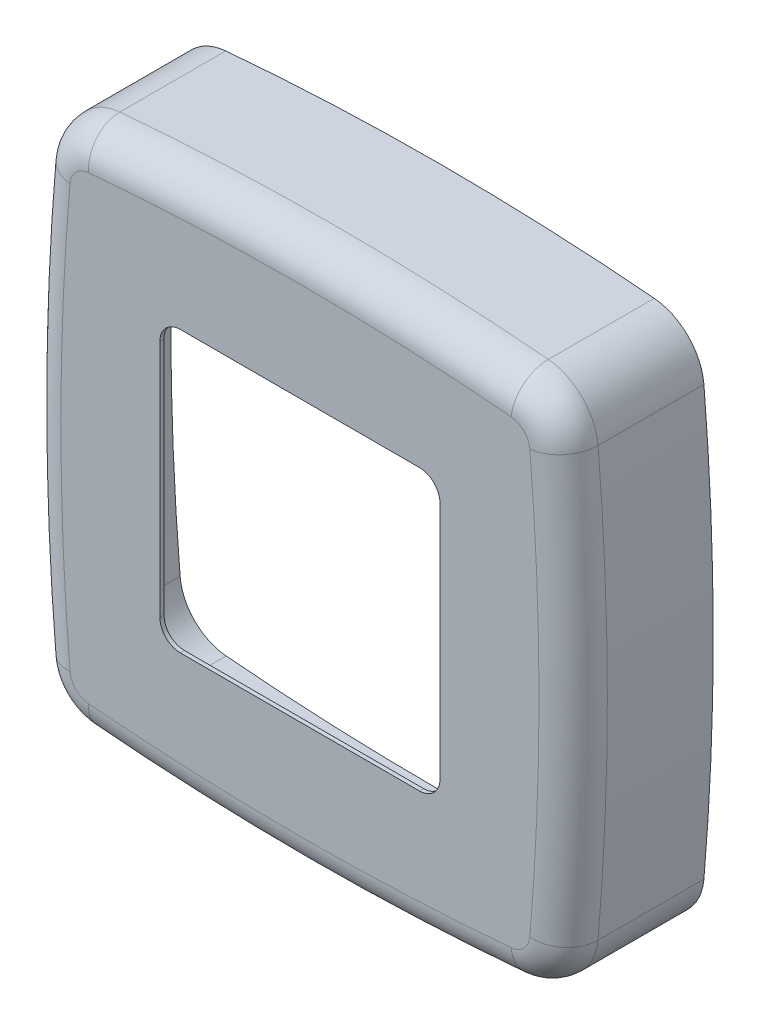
ISO-10303-21;
HEADER;
FILE_DESCRIPTION(('STEP AP214'),'2;1');
FILE_NAME('part.step','',(''),(''),'','','');
FILE_SCHEMA(('AUTOMOTIVE_DESIGN { 1 0 10303 214 1 1 1 1 }'));
ENDSEC;
DATA;
#1=APPLICATION_CONTEXT('core data for automotive mechanical design processes');
#2=APPLICATION_PROTOCOL_DEFINITION('international standard','automotive_design',2000,#1);
#3=PRODUCT_CONTEXT('',#1,'mechanical');
#4=PRODUCT('Part','Part','',(#3));
#5=PRODUCT_RELATED_PRODUCT_CATEGORY('part','',(#4));
#6=PRODUCT_DEFINITION_FORMATION('','',#4);
#7=PRODUCT_DEFINITION_CONTEXT('part definition',#1,'design');
#8=PRODUCT_DEFINITION('design','',#6,#7);
#9=PRODUCT_DEFINITION_SHAPE('','',#8);
#10=(LENGTH_UNIT() NAMED_UNIT(*) SI_UNIT(.MILLI.,.METRE.));
#11=(NAMED_UNIT(*) PLANE_ANGLE_UNIT() SI_UNIT($,.RADIAN.));
#12=(NAMED_UNIT(*) SI_UNIT($,.STERADIAN.) SOLID_ANGLE_UNIT());
#13=UNCERTAINTY_MEASURE_WITH_UNIT(LENGTH_MEASURE(1.E-05),#10,'distance_accuracy_value','');
#14=(GEOMETRIC_REPRESENTATION_CONTEXT(3) GLOBAL_UNCERTAINTY_ASSIGNED_CONTEXT((#13)) GLOBAL_UNIT_ASSIGNED_CONTEXT((#10,
#11,#12)) REPRESENTATION_CONTEXT('',''));
#15=CARTESIAN_POINT('',(0.,0.,0.));
#16=DIRECTION('',(0.,0.,1.));
#17=DIRECTION('',(1.,0.,0.));
#18=AXIS2_PLACEMENT_3D('',#15,#16,#17);
#19=CARTESIAN_POINT('',(20.5,-20.5,-105.732531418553));
#20=DIRECTION('',(0.,1.,0.));
#21=DIRECTION('',(-1.,0.,0.));
#22=AXIS2_PLACEMENT_3D('',#19,#20,#21);
#23=PLANE('',#22);
#24=DIRECTION('',(0.,0.,1.));
#25=VECTOR('',#24,1.);
#26=CARTESIAN_POINT('',(17.5,-20.5,-8.75));
#27=LINE('',#26,#25);
#28=CARTESIAN_POINT('',(17.5,-20.5,8.75));
#29=VERTEX_POINT('',#28);
#30=CARTESIAN_POINT('',(17.5,-20.5,8.15));
#31=VERTEX_POINT('',#30);
#32=EDGE_CURVE('E518',#29,#31,#27,.F.);
#33=ORIENTED_EDGE('',*,*,#32,.T.);
#34=DIRECTION('',(-1.,0.,0.));
#35=VECTOR('',#34,1.);
#36=CARTESIAN_POINT('',(0.,-20.5,8.15));
#37=LINE('',#36,#35);
#38=CARTESIAN_POINT('',(-17.5,-20.5,8.15));
#39=VERTEX_POINT('',#38);
#40=EDGE_CURVE('E325',#31,#39,#37,.T.);
#41=ORIENTED_EDGE('',*,*,#40,.T.);
#42=DIRECTION('',(0.,0.,1.));
#43=VECTOR('',#42,1.);
#44=CARTESIAN_POINT('',(-17.5,-20.5,8.75));
#45=LINE('',#44,#43);
#46=CARTESIAN_POINT('',(-17.5,-20.5,8.75));
#47=VERTEX_POINT('',#46);
#48=EDGE_CURVE('E523',#39,#47,#45,.T.);
#49=ORIENTED_EDGE('',*,*,#48,.T.);
#50=DIRECTION('',(-1.,0.,0.));
#51=VECTOR('',#50,1.);
#52=CARTESIAN_POINT('',(20.5,-20.5,8.75));
#53=LINE('',#52,#51);
#54=EDGE_CURVE('E419',#29,#47,#53,.T.);
#55=ORIENTED_EDGE('',*,*,#54,.F.);
#56=EDGE_LOOP('',(#33,#41,#49,#55));
#57=FACE_BOUND('',#56,.T.);
#58=ADVANCED_FACE('F48',(#57),#23,.T.);
#59=CARTESIAN_POINT('',(-20.5,-20.5,-105.732531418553));
#60=DIRECTION('',(1.,0.,0.));
#61=DIRECTION('',(0.,0.,-1.));
#62=AXIS2_PLACEMENT_3D('',#59,#60,#61);
#63=PLANE('',#62);
#64=DIRECTION('',(0.,0.,1.));
#65=VECTOR('',#64,1.);
#66=CARTESIAN_POINT('',(-20.5,-17.5,-8.75));
#67=LINE('',#66,#65);
#68=CARTESIAN_POINT('',(-20.5,-17.5,8.75));
#69=VERTEX_POINT('',#68);
#70=CARTESIAN_POINT('',(-20.5,-17.5,8.15));
#71=VERTEX_POINT('',#70);
#72=EDGE_CURVE('E525',#69,#71,#67,.F.);
#73=ORIENTED_EDGE('',*,*,#72,.T.);
#74=DIRECTION('',(0.,1.,0.));
#75=VECTOR('',#74,1.);
#76=CARTESIAN_POINT('',(-20.5,0.,8.15));
#77=LINE('',#76,#75);
#78=CARTESIAN_POINT('',(-20.5,17.5,8.15));
#79=VERTEX_POINT('',#78);
#80=EDGE_CURVE('E397',#71,#79,#77,.T.);
#81=ORIENTED_EDGE('',*,*,#80,.T.);
#82=DIRECTION('',(0.,0.,1.));
#83=VECTOR('',#82,1.);
#84=CARTESIAN_POINT('',(-20.5,17.5,8.75));
#85=LINE('',#84,#83);
#86=CARTESIAN_POINT('',(-20.5,17.5,8.75));
#87=VERTEX_POINT('',#86);
#88=EDGE_CURVE('E530',#79,#87,#85,.T.);
#89=ORIENTED_EDGE('',*,*,#88,.T.);
#90=DIRECTION('',(0.,1.,0.));
#91=VECTOR('',#90,1.);
#92=CARTESIAN_POINT('',(-20.5,-20.5,8.75));
#93=LINE('',#92,#91);
#94=EDGE_CURVE('E420',#69,#87,#93,.T.);
#95=ORIENTED_EDGE('',*,*,#94,.F.);
#96=EDGE_LOOP('',(#73,#81,#89,#95));
#97=FACE_BOUND('',#96,.T.);
#98=ADVANCED_FACE('F540',(#97),#63,.T.);
#99=CARTESIAN_POINT('',(-20.5,20.5,-105.732531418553));
#100=DIRECTION('',(0.,-1.,0.));
#101=DIRECTION('',(1.,0.,0.));
#102=AXIS2_PLACEMENT_3D('',#99,#100,#101);
#103=PLANE('',#102);
#104=DIRECTION('',(0.,0.,1.));
#105=VECTOR('',#104,1.);
#106=CARTESIAN_POINT('',(-17.5,20.5,-8.75));
#107=LINE('',#106,#105);
#108=CARTESIAN_POINT('',(-17.5,20.5,8.75));
#109=VERTEX_POINT('',#108);
#110=CARTESIAN_POINT('',(-17.5,20.5,8.15));
#111=VERTEX_POINT('',#110);
#112=EDGE_CURVE('E56',#109,#111,#107,.F.);
#113=ORIENTED_EDGE('',*,*,#112,.T.);
#114=DIRECTION('',(1.,0.,0.));
#115=VECTOR('',#114,1.);
#116=CARTESIAN_POINT('',(0.,20.5,8.15));
#117=LINE('',#116,#115);
#118=CARTESIAN_POINT('',(17.5,20.5,8.15));
#119=VERTEX_POINT('',#118);
#120=EDGE_CURVE('E63',#111,#119,#117,.T.);
#121=ORIENTED_EDGE('',*,*,#120,.T.);
#122=DIRECTION('',(0.,0.,1.));
#123=VECTOR('',#122,1.);
#124=CARTESIAN_POINT('',(17.5,20.5,8.75));
#125=LINE('',#124,#123);
#126=CARTESIAN_POINT('',(17.5,20.5,8.75));
#127=VERTEX_POINT('',#126);
#128=EDGE_CURVE('E489',#119,#127,#125,.T.);
#129=ORIENTED_EDGE('',*,*,#128,.T.);
#130=DIRECTION('',(1.,0.,0.));
#131=VECTOR('',#130,1.);
#132=CARTESIAN_POINT('',(-20.5,20.5,8.75));
#133=LINE('',#132,#131);
#134=EDGE_CURVE('E423',#109,#127,#133,.T.);
#135=ORIENTED_EDGE('',*,*,#134,.F.);
#136=EDGE_LOOP('',(#113,#121,#129,#135));
#137=FACE_BOUND('',#136,.T.);
#138=ADVANCED_FACE('F534',(#137),#103,.T.);
#139=CARTESIAN_POINT('',(20.5,20.5,-105.732531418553));
#140=DIRECTION('',(-1.,0.,0.));
#141=DIRECTION('',(0.,-1.,0.));
#142=AXIS2_PLACEMENT_3D('',#139,#140,#141);
#143=PLANE('',#142);
#144=DIRECTION('',(0.,0.,1.));
#145=VECTOR('',#144,1.);
#146=CARTESIAN_POINT('',(20.5,17.5,-8.75));
#147=LINE('',#146,#145);
#148=CARTESIAN_POINT('',(20.5,17.5,8.75));
#149=VERTEX_POINT('',#148);
#150=CARTESIAN_POINT('',(20.5,17.5,8.15));
#151=VERTEX_POINT('',#150);
#152=EDGE_CURVE('E511',#149,#151,#147,.F.);
#153=ORIENTED_EDGE('',*,*,#152,.T.);
#154=DIRECTION('',(0.,-1.,0.));
#155=VECTOR('',#154,1.);
#156=CARTESIAN_POINT('',(20.5,0.,8.15));
#157=LINE('',#156,#155);
#158=CARTESIAN_POINT('',(20.5,-17.5,8.15));
#159=VERTEX_POINT('',#158);
#160=EDGE_CURVE('E392',#151,#159,#157,.T.);
#161=ORIENTED_EDGE('',*,*,#160,.T.);
#162=DIRECTION('',(0.,0.,1.));
#163=VECTOR('',#162,1.);
#164=CARTESIAN_POINT('',(20.5,-17.5,8.75));
#165=LINE('',#164,#163);
#166=CARTESIAN_POINT('',(20.5,-17.5,8.75));
#167=VERTEX_POINT('',#166);
#168=EDGE_CURVE('E516',#159,#167,#165,.T.);
#169=ORIENTED_EDGE('',*,*,#168,.T.);
#170=DIRECTION('',(0.,-1.,0.));
#171=VECTOR('',#170,1.);
#172=CARTESIAN_POINT('',(20.5,20.5,8.75));
#173=LINE('',#172,#171);
#174=EDGE_CURVE('E426',#149,#167,#173,.T.);
#175=ORIENTED_EDGE('',*,*,#174,.F.);
#176=EDGE_LOOP('',(#153,#161,#169,#175));
#177=FACE_BOUND('',#176,.T.);
#178=ADVANCED_FACE('F555',(#177),#143,.T.);
#179=CARTESIAN_POINT('',(0.,0.,8.75));
#180=DIRECTION('',(0.,0.,1.));
#181=DIRECTION('',(1.,0.,0.));
#182=AXIS2_PLACEMENT_3D('',#179,#180,#181);
#183=PLANE('',#182);
#184=CARTESIAN_POINT('',(-30.6689854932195,-30.6689854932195,8.75));
#185=DIRECTION('',(0.,0.,1.));
#186=DIRECTION('',(1.,0.,0.));
#187=AXIS2_PLACEMENT_3D('',#184,#185,#186);
#188=CIRCLE('',#187,3.);
#189=CARTESIAN_POINT('',(-33.6577057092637,-30.9288921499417,8.75));
#190=VERTEX_POINT('',#189);
#191=CARTESIAN_POINT('',(-30.9288921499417,-33.6577057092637,8.75));
#192=VERTEX_POINT('',#191);
#193=EDGE_CURVE('E467',#190,#192,#188,.T.);
#194=ORIENTED_EDGE('',*,*,#193,.T.);
#195=CARTESIAN_POINT('',(0.,322.,8.75));
#196=DIRECTION('',(0.,0.,1.));
#197=DIRECTION('',(1.,0.,0.));
#198=AXIS2_PLACEMENT_3D('',#195,#196,#197);
#199=CIRCLE('',#198,357.);
#200=CARTESIAN_POINT('',(30.9288921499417,-33.6577057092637,8.75));
#201=VERTEX_POINT('',#200);
#202=EDGE_CURVE('E469',#192,#201,#199,.T.);
#203=ORIENTED_EDGE('',*,*,#202,.T.);
#204=CARTESIAN_POINT('',(30.6689854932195,-30.6689854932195,8.75));
#205=DIRECTION('',(0.,0.,1.));
#206=DIRECTION('',(1.,0.,0.));
#207=AXIS2_PLACEMENT_3D('',#204,#205,#206);
#208=CIRCLE('',#207,3.);
#209=CARTESIAN_POINT('',(33.6577057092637,-30.9288921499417,8.75));
#210=VERTEX_POINT('',#209);
#211=EDGE_CURVE('E465',#201,#210,#208,.T.);
#212=ORIENTED_EDGE('',*,*,#211,.T.);
#213=CARTESIAN_POINT('',(-322.,0.,8.75));
#214=DIRECTION('',(0.,0.,1.));
#215=DIRECTION('',(1.,0.,0.));
#216=AXIS2_PLACEMENT_3D('',#213,#214,#215);
#217=CIRCLE('',#216,357.);
#218=CARTESIAN_POINT('',(33.6577057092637,30.9288921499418,8.75));
#219=VERTEX_POINT('',#218);
#220=EDGE_CURVE('E461',#210,#219,#217,.T.);
#221=ORIENTED_EDGE('',*,*,#220,.T.);
#222=CARTESIAN_POINT('',(30.6689854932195,30.6689854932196,8.75));
#223=DIRECTION('',(0.,0.,1.));
#224=DIRECTION('',(1.,0.,0.));
#225=AXIS2_PLACEMENT_3D('',#222,#223,#224);
#226=CIRCLE('',#225,3.);
#227=CARTESIAN_POINT('',(30.9288921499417,33.6577057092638,8.75));
#228=VERTEX_POINT('',#227);
#229=EDGE_CURVE('E457',#219,#228,#226,.T.);
#230=ORIENTED_EDGE('',*,*,#229,.T.);
#231=CARTESIAN_POINT('',(0.,-322.,8.75));
#232=DIRECTION('',(0.,0.,1.));
#233=DIRECTION('',(1.,0.,0.));
#234=AXIS2_PLACEMENT_3D('',#231,#232,#233);
#235=CIRCLE('',#234,357.);
#236=CARTESIAN_POINT('',(-30.9288921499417,33.6577057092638,8.75));
#237=VERTEX_POINT('',#236);
#238=EDGE_CURVE('E455',#228,#237,#235,.T.);
#239=ORIENTED_EDGE('',*,*,#238,.T.);
#240=CARTESIAN_POINT('',(-30.6689854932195,30.6689854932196,8.75));
#241=DIRECTION('',(0.,0.,1.));
#242=DIRECTION('',(1.,0.,0.));
#243=AXIS2_PLACEMENT_3D('',#240,#241,#242);
#244=CIRCLE('',#243,3.);
#245=CARTESIAN_POINT('',(-33.6577057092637,30.9288921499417,8.75));
#246=VERTEX_POINT('',#245);
#247=EDGE_CURVE('E459',#237,#246,#244,.T.);
#248=ORIENTED_EDGE('',*,*,#247,.T.);
#249=CARTESIAN_POINT('',(322.,0.,8.75));
#250=DIRECTION('',(0.,0.,1.));
#251=DIRECTION('',(1.,0.,0.));
#252=AXIS2_PLACEMENT_3D('',#249,#250,#251);
#253=CIRCLE('',#252,357.);
#254=EDGE_CURVE('E463',#246,#190,#253,.T.);
#255=ORIENTED_EDGE('',*,*,#254,.T.);
#256=EDGE_LOOP('',(#194,#203,#212,#221,#230,#239,#248,#255));
#257=FACE_BOUND('',#256,.T.);
#258=ORIENTED_EDGE('',*,*,#94,.T.);
#259=CARTESIAN_POINT('',(-17.5,17.5,8.75));
#260=DIRECTION('',(0.,0.,1.));
#261=DIRECTION('',(1.,0.,0.));
#262=AXIS2_PLACEMENT_3D('',#259,#260,#261);
#263=CIRCLE('',#262,3.);
#264=EDGE_CURVE('E11',#87,#109,#263,.F.);
#265=ORIENTED_EDGE('',*,*,#264,.T.);
#266=ORIENTED_EDGE('',*,*,#134,.T.);
#267=CARTESIAN_POINT('',(17.5,17.5,8.75));
#268=DIRECTION('',(0.,0.,1.));
#269=DIRECTION('',(1.,0.,0.));
#270=AXIS2_PLACEMENT_3D('',#267,#268,#269);
#271=CIRCLE('',#270,3.);
#272=EDGE_CURVE('E514',#127,#149,#271,.F.);
#273=ORIENTED_EDGE('',*,*,#272,.T.);
#274=ORIENTED_EDGE('',*,*,#174,.T.);
#275=CARTESIAN_POINT('',(17.5,-17.5,8.75));
#276=DIRECTION('',(0.,0.,1.));
#277=DIRECTION('',(1.,0.,0.));
#278=AXIS2_PLACEMENT_3D('',#275,#276,#277);
#279=CIRCLE('',#278,3.);
#280=EDGE_CURVE('E521',#167,#29,#279,.F.);
#281=ORIENTED_EDGE('',*,*,#280,.T.);
#282=ORIENTED_EDGE('',*,*,#54,.T.);
#283=CARTESIAN_POINT('',(-17.5,-17.5,8.75));
#284=DIRECTION('',(0.,0.,1.));
#285=DIRECTION('',(1.,0.,0.));
#286=AXIS2_PLACEMENT_3D('',#283,#284,#285);
#287=CIRCLE('',#286,3.);
#288=EDGE_CURVE('E528',#47,#69,#287,.F.);
#289=ORIENTED_EDGE('',*,*,#288,.T.);
#290=EDGE_LOOP('',(#258,#265,#266,#273,#274,#281,#282,#289));
#291=FACE_BOUND('',#290,.T.);
#292=ADVANCED_FACE('F561',(#257,#291),#183,.T.);
#293=CARTESIAN_POINT('',(0.,322.,-105.732531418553));
#294=DIRECTION('',(0.,0.,1.));
#295=DIRECTION('',(1.,0.,0.));
#296=AXIS2_PLACEMENT_3D('',#293,#294,#295);
#297=CYLINDRICAL_SURFACE('',#296,362.);
#298=DIRECTION('',(0.,0.,1.));
#299=VECTOR('',#298,1.);
#300=CARTESIAN_POINT('',(31.3620699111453,-38.6389060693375,-105.732531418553));
#301=LINE('',#300,#299);
#302=CARTESIAN_POINT('',(31.3620699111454,-38.6389060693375,-11.75));
#303=VERTEX_POINT('',#302);
#304=CARTESIAN_POINT('',(31.3620699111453,-38.6389060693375,3.75));
#305=VERTEX_POINT('',#304);
#306=EDGE_CURVE('E440',#303,#305,#301,.T.);
#307=ORIENTED_EDGE('',*,*,#306,.T.);
#308=CARTESIAN_POINT('',(0.,322.,3.75));
#309=DIRECTION('',(0.,0.,1.));
#310=DIRECTION('',(1.,0.,0.));
#311=AXIS2_PLACEMENT_3D('',#308,#309,#310);
#312=CIRCLE('',#311,362.);
#313=CARTESIAN_POINT('',(-31.3620699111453,-38.6389060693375,3.75));
#314=VERTEX_POINT('',#313);
#315=EDGE_CURVE('E472',#305,#314,#312,.F.);
#316=ORIENTED_EDGE('',*,*,#315,.T.);
#317=DIRECTION('',(0.,0.,1.));
#318=VECTOR('',#317,1.);
#319=CARTESIAN_POINT('',(-31.3620699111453,-38.6389060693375,-105.732531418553));
#320=LINE('',#319,#318);
#321=CARTESIAN_POINT('',(-31.3620699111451,-38.6389060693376,-11.75));
#322=VERTEX_POINT('',#321);
#323=EDGE_CURVE('E448',#314,#322,#320,.F.);
#324=ORIENTED_EDGE('',*,*,#323,.T.);
#325=CARTESIAN_POINT('',(0.,322.,-11.75));
#326=DIRECTION('',(0.,0.,-1.));
#327=DIRECTION('',(-1.,0.,0.));
#328=AXIS2_PLACEMENT_3D('',#325,#326,#327);
#329=CIRCLE('',#328,362.);
#330=EDGE_CURVE('E322',#303,#322,#329,.T.);
#331=ORIENTED_EDGE('',*,*,#330,.F.);
#332=EDGE_LOOP('',(#307,#316,#324,#331));
#333=FACE_BOUND('',#332,.T.);
#334=ADVANCED_FACE('F563',(#333),#297,.T.);
#335=CARTESIAN_POINT('',(322.,0.,-105.732531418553));
#336=DIRECTION('',(0.,0.,1.));
#337=DIRECTION('',(1.,0.,0.));
#338=AXIS2_PLACEMENT_3D('',#335,#336,#337);
#339=CYLINDRICAL_SURFACE('',#338,362.);
#340=DIRECTION('',(0.,0.,1.));
#341=VECTOR('',#340,1.);
#342=CARTESIAN_POINT('',(-38.6389060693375,-31.3620699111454,-105.732531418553));
#343=LINE('',#342,#341);
#344=CARTESIAN_POINT('',(-38.6389060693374,-31.3620699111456,-11.75));
#345=VERTEX_POINT('',#344);
#346=CARTESIAN_POINT('',(-38.6389060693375,-31.3620699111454,3.75));
#347=VERTEX_POINT('',#346);
#348=EDGE_CURVE('E445',#345,#347,#343,.T.);
#349=ORIENTED_EDGE('',*,*,#348,.T.);
#350=CARTESIAN_POINT('',(322.,0.,3.75));
#351=DIRECTION('',(0.,0.,1.));
#352=DIRECTION('',(1.,0.,0.));
#353=AXIS2_PLACEMENT_3D('',#350,#351,#352);
#354=CIRCLE('',#353,362.);
#355=CARTESIAN_POINT('',(-38.6389060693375,31.3620699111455,3.75));
#356=VERTEX_POINT('',#355);
#357=EDGE_CURVE('E479',#347,#356,#354,.F.);
#358=ORIENTED_EDGE('',*,*,#357,.T.);
#359=DIRECTION('',(0.,0.,1.));
#360=VECTOR('',#359,1.);
#361=CARTESIAN_POINT('',(-38.6389060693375,31.3620699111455,-105.732531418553));
#362=LINE('',#361,#360);
#363=CARTESIAN_POINT('',(-38.6389060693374,31.3620699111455,-11.75));
#364=VERTEX_POINT('',#363);
#365=EDGE_CURVE('E453',#356,#364,#362,.F.);
#366=ORIENTED_EDGE('',*,*,#365,.T.);
#367=CARTESIAN_POINT('',(322.,0.,-11.75));
#368=DIRECTION('',(0.,0.,-1.));
#369=DIRECTION('',(-1.,0.,0.));
#370=AXIS2_PLACEMENT_3D('',#367,#368,#369);
#371=CIRCLE('',#370,362.);
#372=EDGE_CURVE('E304',#345,#364,#371,.T.);
#373=ORIENTED_EDGE('',*,*,#372,.F.);
#374=EDGE_LOOP('',(#349,#358,#366,#373));
#375=FACE_BOUND('',#374,.T.);
#376=ADVANCED_FACE('F570',(#375),#339,.T.);
#377=CARTESIAN_POINT('',(0.,-322.,-105.732531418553));
#378=DIRECTION('',(0.,0.,1.));
#379=DIRECTION('',(1.,0.,0.));
#380=AXIS2_PLACEMENT_3D('',#377,#378,#379);
#381=CYLINDRICAL_SURFACE('',#380,362.);
#382=DIRECTION('',(0.,0.,1.));
#383=VECTOR('',#382,1.);
#384=CARTESIAN_POINT('',(-31.3620699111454,38.6389060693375,-105.732531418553));
#385=LINE('',#384,#383);
#386=CARTESIAN_POINT('',(-31.3620699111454,38.6389060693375,-11.75));
#387=VERTEX_POINT('',#386);
#388=CARTESIAN_POINT('',(-31.3620699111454,38.6389060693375,3.75));
#389=VERTEX_POINT('',#388);
#390=EDGE_CURVE('E450',#387,#389,#385,.T.);
#391=ORIENTED_EDGE('',*,*,#390,.T.);
#392=CARTESIAN_POINT('',(0.,-322.,3.75));
#393=DIRECTION('',(0.,0.,1.));
#394=DIRECTION('',(1.,0.,0.));
#395=AXIS2_PLACEMENT_3D('',#392,#393,#394);
#396=CIRCLE('',#395,362.);
#397=CARTESIAN_POINT('',(31.3620699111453,38.6389060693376,3.75));
#398=VERTEX_POINT('',#397);
#399=EDGE_CURVE('E487',#389,#398,#396,.F.);
#400=ORIENTED_EDGE('',*,*,#399,.T.);
#401=DIRECTION('',(0.,0.,1.));
#402=VECTOR('',#401,1.);
#403=CARTESIAN_POINT('',(31.3620699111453,38.6389060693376,-105.732531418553));
#404=LINE('',#403,#402);
#405=CARTESIAN_POINT('',(31.3620699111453,38.6389060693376,-11.75));
#406=VERTEX_POINT('',#405);
#407=EDGE_CURVE('E437',#398,#406,#404,.F.);
#408=ORIENTED_EDGE('',*,*,#407,.T.);
#409=CARTESIAN_POINT('',(0.,-322.,-11.75));
#410=DIRECTION('',(0.,0.,-1.));
#411=DIRECTION('',(-1.,0.,0.));
#412=AXIS2_PLACEMENT_3D('',#409,#410,#411);
#413=CIRCLE('',#412,362.);
#414=EDGE_CURVE('E310',#387,#406,#413,.T.);
#415=ORIENTED_EDGE('',*,*,#414,.F.);
#416=EDGE_LOOP('',(#391,#400,#408,#415));
#417=FACE_BOUND('',#416,.T.);
#418=ADVANCED_FACE('F588',(#417),#381,.T.);
#419=CARTESIAN_POINT('',(-322.,0.,-105.732531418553));
#420=DIRECTION('',(0.,0.,1.));
#421=DIRECTION('',(1.,0.,0.));
#422=AXIS2_PLACEMENT_3D('',#419,#420,#421);
#423=CYLINDRICAL_SURFACE('',#422,362.);
#424=DIRECTION('',(0.,0.,1.));
#425=VECTOR('',#424,1.);
#426=CARTESIAN_POINT('',(38.6389060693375,31.3620699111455,-105.732531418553));
#427=LINE('',#426,#425);
#428=CARTESIAN_POINT('',(38.6389060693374,31.3620699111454,-11.75));
#429=VERTEX_POINT('',#428);
#430=CARTESIAN_POINT('',(38.6389060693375,31.3620699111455,3.75));
#431=VERTEX_POINT('',#430);
#432=EDGE_CURVE('E434',#429,#431,#427,.T.);
#433=ORIENTED_EDGE('',*,*,#432,.T.);
#434=CARTESIAN_POINT('',(-322.,0.,3.75));
#435=DIRECTION('',(0.,0.,1.));
#436=DIRECTION('',(1.,0.,0.));
#437=AXIS2_PLACEMENT_3D('',#434,#435,#436);
#438=CIRCLE('',#437,362.);
#439=CARTESIAN_POINT('',(38.6389060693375,-31.3620699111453,3.75));
#440=VERTEX_POINT('',#439);
#441=EDGE_CURVE('E481',#431,#440,#438,.F.);
#442=ORIENTED_EDGE('',*,*,#441,.T.);
#443=DIRECTION('',(0.,0.,1.));
#444=VECTOR('',#443,1.);
#445=CARTESIAN_POINT('',(38.6389060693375,-31.3620699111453,-105.732531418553));
#446=LINE('',#445,#444);
#447=CARTESIAN_POINT('',(38.6389060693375,-31.3620699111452,-11.75));
#448=VERTEX_POINT('',#447);
#449=EDGE_CURVE('E443',#440,#448,#446,.F.);
#450=ORIENTED_EDGE('',*,*,#449,.T.);
#451=CARTESIAN_POINT('',(-322.,0.,-11.75));
#452=DIRECTION('',(0.,0.,-1.));
#453=DIRECTION('',(-1.,0.,0.));
#454=AXIS2_PLACEMENT_3D('',#451,#452,#453);
#455=CIRCLE('',#454,362.);
#456=EDGE_CURVE('E316',#429,#448,#455,.T.);
#457=ORIENTED_EDGE('',*,*,#456,.F.);
#458=EDGE_LOOP('',(#433,#442,#450,#457));
#459=FACE_BOUND('',#458,.T.);
#460=ADVANCED_FACE('F584',(#459),#423,.T.);
#461=CARTESIAN_POINT('',(30.6689854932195,30.6689854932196,-105.732531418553));
#462=DIRECTION('',(0.,0.,1.));
#463=DIRECTION('',(1.,0.,0.));
#464=AXIS2_PLACEMENT_3D('',#461,#462,#463);
#465=CYLINDRICAL_SURFACE('',#464,8.);
#466=ORIENTED_EDGE('',*,*,#407,.F.);
#467=CARTESIAN_POINT('',(30.6689854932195,30.6689854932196,3.75));
#468=DIRECTION('',(0.,0.,1.));
#469=DIRECTION('',(1.,0.,0.));
#470=AXIS2_PLACEMENT_3D('',#467,#468,#469);
#471=CIRCLE('',#470,8.);
#472=EDGE_CURVE('E485',#398,#431,#471,.F.);
#473=ORIENTED_EDGE('',*,*,#472,.T.);
#474=ORIENTED_EDGE('',*,*,#432,.F.);
#475=CARTESIAN_POINT('',(30.6689854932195,30.6689854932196,-11.75));
#476=DIRECTION('',(0.,0.,-1.));
#477=DIRECTION('',(-1.,0.,0.));
#478=AXIS2_PLACEMENT_3D('',#475,#476,#477);
#479=CIRCLE('',#478,8.00000000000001);
#480=EDGE_CURVE('E313',#406,#429,#479,.T.);
#481=ORIENTED_EDGE('',*,*,#480,.F.);
#482=EDGE_LOOP('',(#466,#473,#474,#481));
#483=FACE_BOUND('',#482,.T.);
#484=ADVANCED_FACE('F587',(#483),#465,.T.);
#485=CARTESIAN_POINT('',(30.6689854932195,-30.6689854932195,-105.732531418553));
#486=DIRECTION('',(0.,0.,1.));
#487=DIRECTION('',(1.,0.,0.));
#488=AXIS2_PLACEMENT_3D('',#485,#486,#487);
#489=CYLINDRICAL_SURFACE('',#488,8.);
#490=ORIENTED_EDGE('',*,*,#449,.F.);
#491=CARTESIAN_POINT('',(30.6689854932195,-30.6689854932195,3.75));
#492=DIRECTION('',(0.,0.,1.));
#493=DIRECTION('',(1.,0.,0.));
#494=AXIS2_PLACEMENT_3D('',#491,#492,#493);
#495=CIRCLE('',#494,8.);
#496=EDGE_CURVE('E477',#440,#305,#495,.F.);
#497=ORIENTED_EDGE('',*,*,#496,.T.);
#498=ORIENTED_EDGE('',*,*,#306,.F.);
#499=CARTESIAN_POINT('',(30.6689854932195,-30.6689854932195,-11.75));
#500=DIRECTION('',(0.,0.,-1.));
#501=DIRECTION('',(-1.,0.,0.));
#502=AXIS2_PLACEMENT_3D('',#499,#500,#501);
#503=CIRCLE('',#502,8.00000000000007);
#504=EDGE_CURVE('E319',#448,#303,#503,.T.);
#505=ORIENTED_EDGE('',*,*,#504,.F.);
#506=EDGE_LOOP('',(#490,#497,#498,#505));
#507=FACE_BOUND('',#506,.T.);
#508=ADVANCED_FACE('F641',(#507),#489,.T.);
#509=CARTESIAN_POINT('',(-30.6689854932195,-30.6689854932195,-105.732531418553));
#510=DIRECTION('',(0.,0.,1.));
#511=DIRECTION('',(1.,0.,0.));
#512=AXIS2_PLACEMENT_3D('',#509,#510,#511);
#513=CYLINDRICAL_SURFACE('',#512,8.);
#514=ORIENTED_EDGE('',*,*,#323,.F.);
#515=CARTESIAN_POINT('',(-30.6689854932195,-30.6689854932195,3.75));
#516=DIRECTION('',(0.,0.,1.));
#517=DIRECTION('',(1.,0.,0.));
#518=AXIS2_PLACEMENT_3D('',#515,#516,#517);
#519=CIRCLE('',#518,8.);
#520=EDGE_CURVE('E475',#314,#347,#519,.F.);
#521=ORIENTED_EDGE('',*,*,#520,.T.);
#522=ORIENTED_EDGE('',*,*,#348,.F.);
#523=CARTESIAN_POINT('',(-30.6689854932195,-30.6689854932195,-11.75));
#524=DIRECTION('',(0.,0.,-1.));
#525=DIRECTION('',(-1.,0.,0.));
#526=AXIS2_PLACEMENT_3D('',#523,#524,#525);
#527=CIRCLE('',#526,8.00000000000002);
#528=EDGE_CURVE('E301',#322,#345,#527,.T.);
#529=ORIENTED_EDGE('',*,*,#528,.F.);
#530=EDGE_LOOP('',(#514,#521,#522,#529));
#531=FACE_BOUND('',#530,.T.);
#532=ADVANCED_FACE('F1059',(#531),#513,.T.);
#533=CARTESIAN_POINT('',(-30.6689854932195,30.6689854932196,-105.732531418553));
#534=DIRECTION('',(0.,0.,1.));
#535=DIRECTION('',(1.,0.,0.));
#536=AXIS2_PLACEMENT_3D('',#533,#534,#535);
#537=CYLINDRICAL_SURFACE('',#536,8.);
#538=ORIENTED_EDGE('',*,*,#365,.F.);
#539=CARTESIAN_POINT('',(-30.6689854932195,30.6689854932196,3.75));
#540=DIRECTION('',(0.,0.,1.));
#541=DIRECTION('',(1.,0.,0.));
#542=AXIS2_PLACEMENT_3D('',#539,#540,#541);
#543=CIRCLE('',#542,8.);
#544=EDGE_CURVE('E483',#356,#389,#543,.F.);
#545=ORIENTED_EDGE('',*,*,#544,.T.);
#546=ORIENTED_EDGE('',*,*,#390,.F.);
#547=CARTESIAN_POINT('',(-30.6689854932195,30.6689854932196,-11.75));
#548=DIRECTION('',(0.,0.,-1.));
#549=DIRECTION('',(-1.,0.,0.));
#550=AXIS2_PLACEMENT_3D('',#547,#548,#549);
#551=CIRCLE('',#550,7.99999999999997);
#552=EDGE_CURVE('E307',#364,#387,#551,.T.);
#553=ORIENTED_EDGE('',*,*,#552,.F.);
#554=EDGE_LOOP('',(#538,#545,#546,#553));
#555=FACE_BOUND('',#554,.T.);
#556=ADVANCED_FACE('F619',(#555),#537,.T.);
#557=CARTESIAN_POINT('',(0.,-322.,3.75));
#558=DIRECTION('',(0.,0.,1.));
#559=DIRECTION('',(1.,0.,0.));
#560=AXIS2_PLACEMENT_3D('',#557,#558,#559);
#561=TOROIDAL_SURFACE('',#560,357.,5.);
#562=CARTESIAN_POINT('',(30.9288921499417,33.6577057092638,3.75));
#563=DIRECTION('',(0.996240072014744,-0.0866355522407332,0.));
#564=DIRECTION('',(0.0866355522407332,0.996240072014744,0.));
#565=AXIS2_PLACEMENT_3D('',#562,#563,#564);
#566=CIRCLE('',#565,5.);
#567=EDGE_CURVE('E505',#398,#228,#566,.T.);
#568=ORIENTED_EDGE('',*,*,#567,.F.);
#569=ORIENTED_EDGE('',*,*,#399,.F.);
#570=CARTESIAN_POINT('',(-30.9288921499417,33.6577057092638,3.75));
#571=DIRECTION('',(-0.996240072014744,-0.0866355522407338,0.));
#572=DIRECTION('',(0.0866355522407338,-0.996240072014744,0.));
#573=AXIS2_PLACEMENT_3D('',#570,#571,#572);
#574=CIRCLE('',#573,5.);
#575=EDGE_CURVE('E438',#237,#389,#574,.T.);
#576=ORIENTED_EDGE('',*,*,#575,.F.);
#577=ORIENTED_EDGE('',*,*,#238,.F.);
#578=EDGE_LOOP('',(#568,#569,#576,#577));
#579=FACE_BOUND('',#578,.T.);
#580=ADVANCED_FACE('F626',(#579),#561,.T.);
#581=CARTESIAN_POINT('',(-30.6689854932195,30.6689854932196,3.75));
#582=DIRECTION('',(0.,0.,1.));
#583=DIRECTION('',(1.,0.,0.));
#584=AXIS2_PLACEMENT_3D('',#581,#582,#583);
#585=DEGENERATE_TOROIDAL_SURFACE('',#584,3.,5.,.T.);
#586=ORIENTED_EDGE('',*,*,#575,.T.);
#587=ORIENTED_EDGE('',*,*,#544,.F.);
#588=CARTESIAN_POINT('',(-33.6577057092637,30.9288921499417,3.75));
#589=DIRECTION('',(-0.0866355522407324,-0.996240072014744,0.));
#590=DIRECTION('',(0.996240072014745,-0.0866355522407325,0.));
#591=AXIS2_PLACEMENT_3D('',#588,#589,#590);
#592=CIRCLE('',#591,5.);
#593=EDGE_CURVE('E502',#246,#356,#592,.T.);
#594=ORIENTED_EDGE('',*,*,#593,.F.);
#595=ORIENTED_EDGE('',*,*,#247,.F.);
#596=EDGE_LOOP('',(#586,#587,#594,#595));
#597=FACE_BOUND('',#596,.T.);
#598=ADVANCED_FACE('F617',(#597),#585,.T.);
#599=CARTESIAN_POINT('',(30.6689854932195,30.6689854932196,3.75));
#600=DIRECTION('',(0.,0.,1.));
#601=DIRECTION('',(1.,0.,0.));
#602=AXIS2_PLACEMENT_3D('',#599,#600,#601);
#603=DEGENERATE_TOROIDAL_SURFACE('',#602,3.,5.,.T.);
#604=ORIENTED_EDGE('',*,*,#567,.T.);
#605=ORIENTED_EDGE('',*,*,#229,.F.);
#606=CARTESIAN_POINT('',(33.6577057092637,30.9288921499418,3.75));
#607=DIRECTION('',(0.0866355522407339,-0.996240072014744,0.));
#608=DIRECTION('',(0.996240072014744,0.0866355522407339,0.));
#609=AXIS2_PLACEMENT_3D('',#606,#607,#608);
#610=CIRCLE('',#609,5.);
#611=EDGE_CURVE('E499',#431,#219,#610,.T.);
#612=ORIENTED_EDGE('',*,*,#611,.F.);
#613=ORIENTED_EDGE('',*,*,#472,.F.);
#614=EDGE_LOOP('',(#604,#605,#612,#613));
#615=FACE_BOUND('',#614,.T.);
#616=ADVANCED_FACE('F631',(#615),#603,.T.);
#617=CARTESIAN_POINT('',(322.,0.,3.75));
#618=DIRECTION('',(0.,0.,1.));
#619=DIRECTION('',(1.,0.,0.));
#620=AXIS2_PLACEMENT_3D('',#617,#618,#619);
#621=TOROIDAL_SURFACE('',#620,357.,5.);
#622=ORIENTED_EDGE('',*,*,#593,.T.);
#623=ORIENTED_EDGE('',*,*,#357,.F.);
#624=CARTESIAN_POINT('',(-33.6577057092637,-30.9288921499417,3.75));
#625=DIRECTION('',(0.0866355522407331,-0.996240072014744,0.));
#626=DIRECTION('',(0.996240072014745,0.0866355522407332,0.));
#627=AXIS2_PLACEMENT_3D('',#624,#625,#626);
#628=CIRCLE('',#627,5.);
#629=EDGE_CURVE('E496',#190,#347,#628,.T.);
#630=ORIENTED_EDGE('',*,*,#629,.F.);
#631=ORIENTED_EDGE('',*,*,#254,.F.);
#632=EDGE_LOOP('',(#622,#623,#630,#631));
#633=FACE_BOUND('',#632,.T.);
#634=ADVANCED_FACE('F603',(#633),#621,.T.);
#635=CARTESIAN_POINT('',(-322.,0.,3.75));
#636=DIRECTION('',(0.,0.,1.));
#637=DIRECTION('',(1.,0.,0.));
#638=AXIS2_PLACEMENT_3D('',#635,#636,#637);
#639=TOROIDAL_SURFACE('',#638,357.,5.);
#640=ORIENTED_EDGE('',*,*,#611,.T.);
#641=ORIENTED_EDGE('',*,*,#220,.F.);
#642=CARTESIAN_POINT('',(33.6577057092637,-30.9288921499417,3.75));
#643=DIRECTION('',(-0.0866355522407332,-0.996240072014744,0.));
#644=DIRECTION('',(0.996240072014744,-0.0866355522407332,0.));
#645=AXIS2_PLACEMENT_3D('',#642,#643,#644);
#646=CIRCLE('',#645,5.);
#647=EDGE_CURVE('E493',#440,#210,#646,.T.);
#648=ORIENTED_EDGE('',*,*,#647,.F.);
#649=ORIENTED_EDGE('',*,*,#441,.F.);
#650=EDGE_LOOP('',(#640,#641,#648,#649));
#651=FACE_BOUND('',#650,.T.);
#652=ADVANCED_FACE('F654',(#651),#639,.T.);
#653=CARTESIAN_POINT('',(-30.6689854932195,-30.6689854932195,3.75));
#654=DIRECTION('',(0.,0.,1.));
#655=DIRECTION('',(1.,0.,0.));
#656=AXIS2_PLACEMENT_3D('',#653,#654,#655);
#657=DEGENERATE_TOROIDAL_SURFACE('',#656,3.,5.,.T.);
#658=ORIENTED_EDGE('',*,*,#629,.T.);
#659=ORIENTED_EDGE('',*,*,#520,.F.);
#660=CARTESIAN_POINT('',(-30.9288921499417,-33.6577057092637,3.75));
#661=DIRECTION('',(0.996240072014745,-0.0866355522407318,0.));
#662=DIRECTION('',(0.0866355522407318,0.996240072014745,0.));
#663=AXIS2_PLACEMENT_3D('',#660,#661,#662);
#664=CIRCLE('',#663,5.);
#665=EDGE_CURVE('E491',#192,#314,#664,.T.);
#666=ORIENTED_EDGE('',*,*,#665,.F.);
#667=ORIENTED_EDGE('',*,*,#193,.F.);
#668=EDGE_LOOP('',(#658,#659,#666,#667));
#669=FACE_BOUND('',#668,.T.);
#670=ADVANCED_FACE('F609',(#669),#657,.T.);
#671=CARTESIAN_POINT('',(30.6689854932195,-30.6689854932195,3.75));
#672=DIRECTION('',(0.,0.,1.));
#673=DIRECTION('',(1.,0.,0.));
#674=AXIS2_PLACEMENT_3D('',#671,#672,#673);
#675=DEGENERATE_TOROIDAL_SURFACE('',#674,3.,5.,.T.);
#676=ORIENTED_EDGE('',*,*,#647,.T.);
#677=ORIENTED_EDGE('',*,*,#211,.F.);
#678=CARTESIAN_POINT('',(30.9288921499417,-33.6577057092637,3.75));
#679=DIRECTION('',(-0.996240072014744,-0.0866355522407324,0.));
#680=DIRECTION('',(0.0866355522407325,-0.996240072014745,0.));
#681=AXIS2_PLACEMENT_3D('',#678,#679,#680);
#682=CIRCLE('',#681,5.);
#683=EDGE_CURVE('E430',#305,#201,#682,.T.);
#684=ORIENTED_EDGE('',*,*,#683,.F.);
#685=ORIENTED_EDGE('',*,*,#496,.F.);
#686=EDGE_LOOP('',(#676,#677,#684,#685));
#687=FACE_BOUND('',#686,.T.);
#688=ADVANCED_FACE('F651',(#687),#675,.T.);
#689=CARTESIAN_POINT('',(0.,322.,3.75));
#690=DIRECTION('',(0.,0.,1.));
#691=DIRECTION('',(1.,0.,0.));
#692=AXIS2_PLACEMENT_3D('',#689,#690,#691);
#693=TOROIDAL_SURFACE('',#692,357.,5.);
#694=ORIENTED_EDGE('',*,*,#665,.T.);
#695=ORIENTED_EDGE('',*,*,#315,.F.);
#696=ORIENTED_EDGE('',*,*,#683,.T.);
#697=ORIENTED_EDGE('',*,*,#202,.F.);
#698=EDGE_LOOP('',(#694,#695,#696,#697));
#699=FACE_BOUND('',#698,.T.);
#700=ADVANCED_FACE('F648',(#699),#693,.T.);
#701=CARTESIAN_POINT('',(17.5,17.5,-105.732531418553));
#702=DIRECTION('',(0.,0.,-1.));
#703=DIRECTION('',(-1.,0.,0.));
#704=AXIS2_PLACEMENT_3D('',#701,#702,#703);
#705=CYLINDRICAL_SURFACE('',#704,3.);
#706=ORIENTED_EDGE('',*,*,#128,.F.);
#707=CARTESIAN_POINT('',(17.5,17.5,8.15));
#708=DIRECTION('',(0.,0.,1.));
#709=DIRECTION('',(1.,0.,0.));
#710=AXIS2_PLACEMENT_3D('',#707,#708,#709);
#711=CIRCLE('',#710,3.);
#712=EDGE_CURVE('E350',#119,#151,#711,.F.);
#713=ORIENTED_EDGE('',*,*,#712,.T.);
#714=ORIENTED_EDGE('',*,*,#152,.F.);
#715=ORIENTED_EDGE('',*,*,#272,.F.);
#716=EDGE_LOOP('',(#706,#713,#714,#715));
#717=FACE_BOUND('',#716,.T.);
#718=ADVANCED_FACE('F560',(#717),#705,.F.);
#719=CARTESIAN_POINT('',(17.5,-17.5,-105.732531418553));
#720=DIRECTION('',(0.,0.,-1.));
#721=DIRECTION('',(-1.,0.,0.));
#722=AXIS2_PLACEMENT_3D('',#719,#720,#721);
#723=CYLINDRICAL_SURFACE('',#722,3.);
#724=ORIENTED_EDGE('',*,*,#168,.F.);
#725=CARTESIAN_POINT('',(17.5,-17.5,8.15));
#726=DIRECTION('',(0.,0.,1.));
#727=DIRECTION('',(1.,0.,0.));
#728=AXIS2_PLACEMENT_3D('',#725,#726,#727);
#729=CIRCLE('',#728,3.);
#730=EDGE_CURVE('E405',#159,#31,#729,.F.);
#731=ORIENTED_EDGE('',*,*,#730,.T.);
#732=ORIENTED_EDGE('',*,*,#32,.F.);
#733=ORIENTED_EDGE('',*,*,#280,.F.);
#734=EDGE_LOOP('',(#724,#731,#732,#733));
#735=FACE_BOUND('',#734,.T.);
#736=ADVANCED_FACE('F553',(#735),#723,.F.);
#737=CARTESIAN_POINT('',(-17.5,-17.5,-105.732531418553));
#738=DIRECTION('',(0.,0.,-1.));
#739=DIRECTION('',(-1.,0.,0.));
#740=AXIS2_PLACEMENT_3D('',#737,#738,#739);
#741=CYLINDRICAL_SURFACE('',#740,3.);
#742=ORIENTED_EDGE('',*,*,#48,.F.);
#743=CARTESIAN_POINT('',(-17.5,-17.5,8.15));
#744=DIRECTION('',(0.,0.,1.));
#745=DIRECTION('',(1.,0.,0.));
#746=AXIS2_PLACEMENT_3D('',#743,#744,#745);
#747=CIRCLE('',#746,3.);
#748=EDGE_CURVE('E401',#39,#71,#747,.F.);
#749=ORIENTED_EDGE('',*,*,#748,.T.);
#750=ORIENTED_EDGE('',*,*,#72,.F.);
#751=ORIENTED_EDGE('',*,*,#288,.F.);
#752=EDGE_LOOP('',(#742,#749,#750,#751));
#753=FACE_BOUND('',#752,.T.);
#754=ADVANCED_FACE('F546',(#753),#741,.F.);
#755=CARTESIAN_POINT('',(-17.5,17.5,-105.732531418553));
#756=DIRECTION('',(0.,0.,-1.));
#757=DIRECTION('',(-1.,0.,0.));
#758=AXIS2_PLACEMENT_3D('',#755,#756,#757);
#759=CYLINDRICAL_SURFACE('',#758,3.);
#760=ORIENTED_EDGE('',*,*,#88,.F.);
#761=CARTESIAN_POINT('',(-17.5,17.5,8.15));
#762=DIRECTION('',(0.,0.,1.));
#763=DIRECTION('',(1.,0.,0.));
#764=AXIS2_PLACEMENT_3D('',#761,#762,#763);
#765=CIRCLE('',#764,3.);
#766=EDGE_CURVE('E404',#79,#111,#765,.F.);
#767=ORIENTED_EDGE('',*,*,#766,.T.);
#768=ORIENTED_EDGE('',*,*,#112,.F.);
#769=ORIENTED_EDGE('',*,*,#264,.F.);
#770=EDGE_LOOP('',(#760,#767,#768,#769));
#771=FACE_BOUND('',#770,.T.);
#772=ADVANCED_FACE('F50',(#771),#759,.F.);
#773=CARTESIAN_POINT('',(0.,0.,8.15));
#774=DIRECTION('',(0.,0.,1.));
#775=DIRECTION('',(1.,0.,0.));
#776=AXIS2_PLACEMENT_3D('',#773,#774,#775);
#777=PLANE('',#776);
#778=CARTESIAN_POINT('',(-30.6689854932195,-30.6689854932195,8.15));
#779=DIRECTION('',(0.,0.,1.));
#780=DIRECTION('',(1.,0.,0.));
#781=AXIS2_PLACEMENT_3D('',#778,#779,#780);
#782=CIRCLE('',#781,3.);
#783=CARTESIAN_POINT('',(-33.6577057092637,-30.9288921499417,8.15));
#784=VERTEX_POINT('',#783);
#785=CARTESIAN_POINT('',(-30.9288921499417,-33.6577057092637,8.15));
#786=VERTEX_POINT('',#785);
#787=EDGE_CURVE('E326',#784,#786,#782,.T.);
#788=ORIENTED_EDGE('',*,*,#787,.F.);
#789=CARTESIAN_POINT('',(322.,0.,8.15));
#790=DIRECTION('',(0.,0.,1.));
#791=DIRECTION('',(1.,0.,0.));
#792=AXIS2_PLACEMENT_3D('',#789,#790,#791);
#793=CIRCLE('',#792,357.);
#794=CARTESIAN_POINT('',(-33.6577057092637,30.9288921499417,8.15));
#795=VERTEX_POINT('',#794);
#796=EDGE_CURVE('E334',#795,#784,#793,.T.);
#797=ORIENTED_EDGE('',*,*,#796,.F.);
#798=CARTESIAN_POINT('',(-30.6689854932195,30.6689854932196,8.15));
#799=DIRECTION('',(0.,0.,1.));
#800=DIRECTION('',(1.,0.,0.));
#801=AXIS2_PLACEMENT_3D('',#798,#799,#800);
#802=CIRCLE('',#801,3.);
#803=CARTESIAN_POINT('',(-30.9288921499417,33.6577057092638,8.15));
#804=VERTEX_POINT('',#803);
#805=EDGE_CURVE('E337',#804,#795,#802,.T.);
#806=ORIENTED_EDGE('',*,*,#805,.F.);
#807=CARTESIAN_POINT('',(0.,-322.,8.15));
#808=DIRECTION('',(0.,0.,1.));
#809=DIRECTION('',(1.,0.,0.));
#810=AXIS2_PLACEMENT_3D('',#807,#808,#809);
#811=CIRCLE('',#810,357.);
#812=CARTESIAN_POINT('',(30.9288921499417,33.6577057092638,8.15));
#813=VERTEX_POINT('',#812);
#814=EDGE_CURVE('E340',#813,#804,#811,.T.);
#815=ORIENTED_EDGE('',*,*,#814,.F.);
#816=CARTESIAN_POINT('',(30.6689854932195,30.6689854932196,8.15));
#817=DIRECTION('',(0.,0.,1.));
#818=DIRECTION('',(1.,0.,0.));
#819=AXIS2_PLACEMENT_3D('',#816,#817,#818);
#820=CIRCLE('',#819,3.);
#821=CARTESIAN_POINT('',(33.6577057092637,30.9288921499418,8.15));
#822=VERTEX_POINT('',#821);
#823=EDGE_CURVE('E338',#822,#813,#820,.T.);
#824=ORIENTED_EDGE('',*,*,#823,.F.);
#825=CARTESIAN_POINT('',(-322.,0.,8.15));
#826=DIRECTION('',(0.,0.,1.));
#827=DIRECTION('',(1.,0.,0.));
#828=AXIS2_PLACEMENT_3D('',#825,#826,#827);
#829=CIRCLE('',#828,357.);
#830=CARTESIAN_POINT('',(33.6577057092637,-30.9288921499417,8.15));
#831=VERTEX_POINT('',#830);
#832=EDGE_CURVE('E335',#831,#822,#829,.T.);
#833=ORIENTED_EDGE('',*,*,#832,.F.);
#834=CARTESIAN_POINT('',(30.6689854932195,-30.6689854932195,8.15));
#835=DIRECTION('',(0.,0.,1.));
#836=DIRECTION('',(1.,0.,0.));
#837=AXIS2_PLACEMENT_3D('',#834,#835,#836);
#838=CIRCLE('',#837,3.);
#839=CARTESIAN_POINT('',(30.9288921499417,-33.6577057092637,8.15));
#840=VERTEX_POINT('',#839);
#841=EDGE_CURVE('E329',#840,#831,#838,.T.);
#842=ORIENTED_EDGE('',*,*,#841,.F.);
#843=CARTESIAN_POINT('',(0.,322.,8.15));
#844=DIRECTION('',(0.,0.,1.));
#845=DIRECTION('',(1.,0.,0.));
#846=AXIS2_PLACEMENT_3D('',#843,#844,#845);
#847=CIRCLE('',#846,357.);
#848=EDGE_CURVE('E328',#786,#840,#847,.T.);
#849=ORIENTED_EDGE('',*,*,#848,.F.);
#850=EDGE_LOOP('',(#788,#797,#806,#815,#824,#833,#842,#849));
#851=FACE_BOUND('',#850,.T.);
#852=ORIENTED_EDGE('',*,*,#80,.F.);
#853=ORIENTED_EDGE('',*,*,#748,.F.);
#854=ORIENTED_EDGE('',*,*,#40,.F.);
#855=ORIENTED_EDGE('',*,*,#730,.F.);
#856=ORIENTED_EDGE('',*,*,#160,.F.);
#857=ORIENTED_EDGE('',*,*,#712,.F.);
#858=ORIENTED_EDGE('',*,*,#120,.F.);
#859=ORIENTED_EDGE('',*,*,#766,.F.);
#860=EDGE_LOOP('',(#852,#853,#854,#855,#856,#857,#858,#859));
#861=FACE_BOUND('',#860,.T.);
#862=ADVANCED_FACE('F538',(#851,#861),#777,.F.);
#863=CARTESIAN_POINT('',(0.,322.,-105.732531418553));
#864=DIRECTION('',(0.,0.,1.));
#865=DIRECTION('',(1.,0.,0.));
#866=AXIS2_PLACEMENT_3D('',#863,#864,#865);
#867=CYLINDRICAL_SURFACE('',#866,361.4);
#868=DIRECTION('',(0.,0.,1.));
#869=VECTOR('',#868,1.);
#870=CARTESIAN_POINT('',(31.3100885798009,-38.0411620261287,-105.732531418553));
#871=LINE('',#870,#869);
#872=CARTESIAN_POINT('',(31.3100885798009,-38.0411620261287,-11.75));
#873=VERTEX_POINT('',#872);
#874=CARTESIAN_POINT('',(31.3100885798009,-38.0411620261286,3.75));
#875=VERTEX_POINT('',#874);
#876=EDGE_CURVE('E356',#873,#875,#871,.T.);
#877=ORIENTED_EDGE('',*,*,#876,.F.);
#878=CARTESIAN_POINT('',(0.,322.,-11.75));
#879=DIRECTION('',(0.,0.,-1.));
#880=DIRECTION('',(-1.,0.,0.));
#881=AXIS2_PLACEMENT_3D('',#878,#879,#880);
#882=CIRCLE('',#881,361.4);
#883=CARTESIAN_POINT('',(-31.310088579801,-38.0411620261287,-11.75));
#884=VERTEX_POINT('',#883);
#885=EDGE_CURVE('E293',#873,#884,#882,.T.);
#886=ORIENTED_EDGE('',*,*,#885,.T.);
#887=DIRECTION('',(0.,0.,1.));
#888=VECTOR('',#887,1.);
#889=CARTESIAN_POINT('',(-31.310088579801,-38.0411620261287,-105.732531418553));
#890=LINE('',#889,#888);
#891=CARTESIAN_POINT('',(-31.310088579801,-38.0411620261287,3.75));
#892=VERTEX_POINT('',#891);
#893=EDGE_CURVE('E270',#892,#884,#890,.F.);
#894=ORIENTED_EDGE('',*,*,#893,.F.);
#895=CARTESIAN_POINT('',(0.,322.,3.75));
#896=DIRECTION('',(0.,0.,1.));
#897=DIRECTION('',(1.,0.,0.));
#898=AXIS2_PLACEMENT_3D('',#895,#896,#897);
#899=CIRCLE('',#898,361.4);
#900=EDGE_CURVE('E332',#875,#892,#899,.F.);
#901=ORIENTED_EDGE('',*,*,#900,.F.);
#902=EDGE_LOOP('',(#877,#886,#894,#901));
#903=FACE_BOUND('',#902,.T.);
#904=ADVANCED_FACE('F681',(#903),#867,.F.);
#905=CARTESIAN_POINT('',(322.,0.,-105.732531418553));
#906=DIRECTION('',(0.,0.,1.));
#907=DIRECTION('',(1.,0.,0.));
#908=AXIS2_PLACEMENT_3D('',#905,#906,#907);
#909=CYLINDRICAL_SURFACE('',#908,361.4);
#910=DIRECTION('',(0.,0.,1.));
#911=VECTOR('',#910,1.);
#912=CARTESIAN_POINT('',(-38.0411620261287,-31.3100885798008,-105.732531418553));
#913=LINE('',#912,#911);
#914=CARTESIAN_POINT('',(-38.0411620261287,-31.3100885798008,-11.75));
#915=VERTEX_POINT('',#914);
#916=CARTESIAN_POINT('',(-38.0411620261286,-31.310088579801,3.75));
#917=VERTEX_POINT('',#916);
#918=EDGE_CURVE('E366',#915,#917,#913,.T.);
#919=ORIENTED_EDGE('',*,*,#918,.F.);
#920=CARTESIAN_POINT('',(322.,0.,-11.75));
#921=DIRECTION('',(0.,0.,-1.));
#922=DIRECTION('',(-1.,0.,0.));
#923=AXIS2_PLACEMENT_3D('',#920,#921,#922);
#924=CIRCLE('',#923,361.4);
#925=CARTESIAN_POINT('',(-38.0411620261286,31.3100885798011,-11.75));
#926=VERTEX_POINT('',#925);
#927=EDGE_CURVE('E299',#915,#926,#924,.T.);
#928=ORIENTED_EDGE('',*,*,#927,.T.);
#929=DIRECTION('',(0.,0.,1.));
#930=VECTOR('',#929,1.);
#931=CARTESIAN_POINT('',(-38.0411620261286,31.310088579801,-105.732531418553));
#932=LINE('',#931,#930);
#933=CARTESIAN_POINT('',(-38.0411620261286,31.310088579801,3.75));
#934=VERTEX_POINT('',#933);
#935=EDGE_CURVE('E269',#934,#926,#932,.F.);
#936=ORIENTED_EDGE('',*,*,#935,.F.);
#937=CARTESIAN_POINT('',(322.,0.,3.75));
#938=DIRECTION('',(0.,0.,1.));
#939=DIRECTION('',(1.,0.,0.));
#940=AXIS2_PLACEMENT_3D('',#937,#938,#939);
#941=CIRCLE('',#940,361.4);
#942=EDGE_CURVE('E363',#917,#934,#941,.F.);
#943=ORIENTED_EDGE('',*,*,#942,.F.);
#944=EDGE_LOOP('',(#919,#928,#936,#943));
#945=FACE_BOUND('',#944,.T.);
#946=ADVANCED_FACE('F687',(#945),#909,.F.);
#947=CARTESIAN_POINT('',(0.,-322.,-105.732531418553));
#948=DIRECTION('',(0.,0.,1.));
#949=DIRECTION('',(1.,0.,0.));
#950=AXIS2_PLACEMENT_3D('',#947,#948,#949);
#951=CYLINDRICAL_SURFACE('',#950,361.4);
#952=DIRECTION('',(0.,0.,1.));
#953=VECTOR('',#952,1.);
#954=CARTESIAN_POINT('',(-31.310088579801,38.0411620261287,-105.732531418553));
#955=LINE('',#954,#953);
#956=CARTESIAN_POINT('',(-31.310088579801,38.0411620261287,-11.75));
#957=VERTEX_POINT('',#956);
#958=CARTESIAN_POINT('',(-31.310088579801,38.0411620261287,3.75));
#959=VERTEX_POINT('',#958);
#960=EDGE_CURVE('E258',#957,#959,#955,.T.);
#961=ORIENTED_EDGE('',*,*,#960,.F.);
#962=CARTESIAN_POINT('',(0.,-322.,-11.75));
#963=DIRECTION('',(0.,0.,-1.));
#964=DIRECTION('',(-1.,0.,0.));
#965=AXIS2_PLACEMENT_3D('',#962,#963,#964);
#966=CIRCLE('',#965,361.4);
#967=CARTESIAN_POINT('',(31.3100885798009,38.0411620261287,-11.75));
#968=VERTEX_POINT('',#967);
#969=EDGE_CURVE('E263',#957,#968,#966,.T.);
#970=ORIENTED_EDGE('',*,*,#969,.T.);
#971=DIRECTION('',(0.,0.,1.));
#972=VECTOR('',#971,1.);
#973=CARTESIAN_POINT('',(31.3100885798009,38.0411620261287,-105.732531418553));
#974=LINE('',#973,#972);
#975=CARTESIAN_POINT('',(31.3100885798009,38.0411620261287,3.75));
#976=VERTEX_POINT('',#975);
#977=EDGE_CURVE('E354',#976,#968,#974,.F.);
#978=ORIENTED_EDGE('',*,*,#977,.F.);
#979=CARTESIAN_POINT('',(0.,-322.,3.75));
#980=DIRECTION('',(0.,0.,1.));
#981=DIRECTION('',(1.,0.,0.));
#982=AXIS2_PLACEMENT_3D('',#979,#980,#981);
#983=CIRCLE('',#982,361.4);
#984=EDGE_CURVE('E265',#959,#976,#983,.F.);
#985=ORIENTED_EDGE('',*,*,#984,.F.);
#986=EDGE_LOOP('',(#961,#970,#978,#985));
#987=FACE_BOUND('',#986,.T.);
#988=ADVANCED_FACE('F260',(#987),#951,.F.);
#989=CARTESIAN_POINT('',(-322.,0.,-105.732531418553));
#990=DIRECTION('',(0.,0.,1.));
#991=DIRECTION('',(1.,0.,0.));
#992=AXIS2_PLACEMENT_3D('',#989,#990,#991);
#993=CYLINDRICAL_SURFACE('',#992,361.4);
#994=DIRECTION('',(0.,0.,1.));
#995=VECTOR('',#994,1.);
#996=CARTESIAN_POINT('',(38.0411620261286,31.310088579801,-105.732531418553));
#997=LINE('',#996,#995);
#998=CARTESIAN_POINT('',(38.0411620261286,31.310088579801,-11.75));
#999=VERTEX_POINT('',#998);
#1000=CARTESIAN_POINT('',(38.0411620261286,31.310088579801,3.75));
#1001=VERTEX_POINT('',#1000);
#1002=EDGE_CURVE('E352',#999,#1001,#997,.T.);
#1003=ORIENTED_EDGE('',*,*,#1002,.F.);
#1004=CARTESIAN_POINT('',(-322.,0.,-11.75));
#1005=DIRECTION('',(0.,0.,-1.));
#1006=DIRECTION('',(-1.,0.,0.));
#1007=AXIS2_PLACEMENT_3D('',#1004,#1005,#1006);
#1008=CIRCLE('',#1007,361.4);
#1009=CARTESIAN_POINT('',(38.0411620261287,-31.3100885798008,-11.75));
#1010=VERTEX_POINT('',#1009);
#1011=EDGE_CURVE('E285',#999,#1010,#1008,.T.);
#1012=ORIENTED_EDGE('',*,*,#1011,.T.);
#1013=DIRECTION('',(0.,0.,1.));
#1014=VECTOR('',#1013,1.);
#1015=CARTESIAN_POINT('',(38.0411620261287,-31.3100885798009,-105.732531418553));
#1016=LINE('',#1015,#1014);
#1017=CARTESIAN_POINT('',(38.0411620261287,-31.3100885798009,3.75));
#1018=VERTEX_POINT('',#1017);
#1019=EDGE_CURVE('E364',#1018,#1010,#1016,.F.);
#1020=ORIENTED_EDGE('',*,*,#1019,.F.);
#1021=CARTESIAN_POINT('',(-322.,0.,3.75));
#1022=DIRECTION('',(0.,0.,1.));
#1023=DIRECTION('',(1.,0.,0.));
#1024=AXIS2_PLACEMENT_3D('',#1021,#1022,#1023);
#1025=CIRCLE('',#1024,361.4);
#1026=EDGE_CURVE('E361',#1001,#1018,#1025,.F.);
#1027=ORIENTED_EDGE('',*,*,#1026,.F.);
#1028=EDGE_LOOP('',(#1003,#1012,#1020,#1027));
#1029=FACE_BOUND('',#1028,.T.);
#1030=ADVANCED_FACE('F698',(#1029),#993,.F.);
#1031=CARTESIAN_POINT('',(30.6689854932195,30.6689854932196,-105.732531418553));
#1032=DIRECTION('',(0.,0.,1.));
#1033=DIRECTION('',(1.,0.,0.));
#1034=AXIS2_PLACEMENT_3D('',#1031,#1032,#1033);
#1035=CYLINDRICAL_SURFACE('',#1034,7.4);
#1036=ORIENTED_EDGE('',*,*,#977,.T.);
#1037=CARTESIAN_POINT('',(30.6689854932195,30.6689854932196,-11.75));
#1038=DIRECTION('',(0.,0.,-1.));
#1039=DIRECTION('',(-1.,0.,0.));
#1040=AXIS2_PLACEMENT_3D('',#1037,#1038,#1039);
#1041=CIRCLE('',#1040,7.39999999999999);
#1042=EDGE_CURVE('E283',#968,#999,#1041,.T.);
#1043=ORIENTED_EDGE('',*,*,#1042,.T.);
#1044=ORIENTED_EDGE('',*,*,#1002,.T.);
#1045=CARTESIAN_POINT('',(30.6689854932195,30.6689854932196,3.75));
#1046=DIRECTION('',(0.,0.,1.));
#1047=DIRECTION('',(1.,0.,0.));
#1048=AXIS2_PLACEMENT_3D('',#1045,#1046,#1047);
#1049=CIRCLE('',#1048,7.4);
#1050=EDGE_CURVE('E351',#976,#1001,#1049,.F.);
#1051=ORIENTED_EDGE('',*,*,#1050,.F.);
#1052=EDGE_LOOP('',(#1036,#1043,#1044,#1051));
#1053=FACE_BOUND('',#1052,.T.);
#1054=ADVANCED_FACE('F701',(#1053),#1035,.F.);
#1055=CARTESIAN_POINT('',(30.6689854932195,-30.6689854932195,-105.732531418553));
#1056=DIRECTION('',(0.,0.,1.));
#1057=DIRECTION('',(1.,0.,0.));
#1058=AXIS2_PLACEMENT_3D('',#1055,#1056,#1057);
#1059=CYLINDRICAL_SURFACE('',#1058,7.4);
#1060=ORIENTED_EDGE('',*,*,#1019,.T.);
#1061=CARTESIAN_POINT('',(30.6689854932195,-30.6689854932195,-11.75));
#1062=DIRECTION('',(0.,0.,-1.));
#1063=DIRECTION('',(-1.,0.,0.));
#1064=AXIS2_PLACEMENT_3D('',#1061,#1062,#1063);
#1065=CIRCLE('',#1064,7.40000000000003);
#1066=EDGE_CURVE('E290',#1010,#873,#1065,.T.);
#1067=ORIENTED_EDGE('',*,*,#1066,.T.);
#1068=ORIENTED_EDGE('',*,*,#876,.T.);
#1069=CARTESIAN_POINT('',(30.6689854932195,-30.6689854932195,3.75));
#1070=DIRECTION('',(0.,0.,1.));
#1071=DIRECTION('',(1.,0.,0.));
#1072=AXIS2_PLACEMENT_3D('',#1069,#1070,#1071);
#1073=CIRCLE('',#1072,7.4);
#1074=EDGE_CURVE('E367',#1018,#875,#1073,.F.);
#1075=ORIENTED_EDGE('',*,*,#1074,.F.);
#1076=EDGE_LOOP('',(#1060,#1067,#1068,#1075));
#1077=FACE_BOUND('',#1076,.T.);
#1078=ADVANCED_FACE('F705',(#1077),#1059,.F.);
#1079=CARTESIAN_POINT('',(-30.6689854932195,-30.6689854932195,-105.732531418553));
#1080=DIRECTION('',(0.,0.,1.));
#1081=DIRECTION('',(1.,0.,0.));
#1082=AXIS2_PLACEMENT_3D('',#1079,#1080,#1081);
#1083=CYLINDRICAL_SURFACE('',#1082,7.4);
#1084=ORIENTED_EDGE('',*,*,#893,.T.);
#1085=CARTESIAN_POINT('',(-30.6689854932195,-30.6689854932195,-11.75));
#1086=DIRECTION('',(0.,0.,-1.));
#1087=DIRECTION('',(-1.,0.,0.));
#1088=AXIS2_PLACEMENT_3D('',#1085,#1086,#1087);
#1089=CIRCLE('',#1088,7.40000000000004);
#1090=EDGE_CURVE('E296',#884,#915,#1089,.T.);
#1091=ORIENTED_EDGE('',*,*,#1090,.T.);
#1092=ORIENTED_EDGE('',*,*,#918,.T.);
#1093=CARTESIAN_POINT('',(-30.6689854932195,-30.6689854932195,3.75));
#1094=DIRECTION('',(0.,0.,1.));
#1095=DIRECTION('',(1.,0.,0.));
#1096=AXIS2_PLACEMENT_3D('',#1093,#1094,#1095);
#1097=CIRCLE('',#1096,7.4);
#1098=EDGE_CURVE('E369',#892,#917,#1097,.F.);
#1099=ORIENTED_EDGE('',*,*,#1098,.F.);
#1100=EDGE_LOOP('',(#1084,#1091,#1092,#1099));
#1101=FACE_BOUND('',#1100,.T.);
#1102=ADVANCED_FACE('F709',(#1101),#1083,.F.);
#1103=CARTESIAN_POINT('',(-30.6689854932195,30.6689854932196,-105.732531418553));
#1104=DIRECTION('',(0.,0.,1.));
#1105=DIRECTION('',(1.,0.,0.));
#1106=AXIS2_PLACEMENT_3D('',#1103,#1104,#1105);
#1107=CYLINDRICAL_SURFACE('',#1106,7.4);
#1108=ORIENTED_EDGE('',*,*,#935,.T.);
#1109=CARTESIAN_POINT('',(-30.6689854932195,30.6689854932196,-11.75));
#1110=DIRECTION('',(0.,0.,-1.));
#1111=DIRECTION('',(-1.,0.,0.));
#1112=AXIS2_PLACEMENT_3D('',#1109,#1110,#1111);
#1113=CIRCLE('',#1112,7.4);
#1114=EDGE_CURVE('E273',#926,#957,#1113,.T.);
#1115=ORIENTED_EDGE('',*,*,#1114,.T.);
#1116=ORIENTED_EDGE('',*,*,#960,.T.);
#1117=CARTESIAN_POINT('',(-30.6689854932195,30.6689854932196,3.75));
#1118=DIRECTION('',(0.,0.,1.));
#1119=DIRECTION('',(1.,0.,0.));
#1120=AXIS2_PLACEMENT_3D('',#1117,#1118,#1119);
#1121=CIRCLE('',#1120,7.4);
#1122=EDGE_CURVE('E358',#934,#959,#1121,.F.);
#1123=ORIENTED_EDGE('',*,*,#1122,.F.);
#1124=EDGE_LOOP('',(#1108,#1115,#1116,#1123));
#1125=FACE_BOUND('',#1124,.T.);
#1126=ADVANCED_FACE('F274',(#1125),#1107,.F.);
#1127=CARTESIAN_POINT('',(0.,-322.,3.75));
#1128=DIRECTION('',(0.,0.,1.));
#1129=DIRECTION('',(1.,0.,0.));
#1130=AXIS2_PLACEMENT_3D('',#1127,#1128,#1129);
#1131=TOROIDAL_SURFACE('',#1130,357.,4.4);
#1132=CARTESIAN_POINT('',(30.9288921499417,33.6577057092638,3.75));
#1133=DIRECTION('',(0.996240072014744,-0.0866355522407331,0.));
#1134=DIRECTION('',(0.0866355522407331,0.996240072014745,0.));
#1135=AXIS2_PLACEMENT_3D('',#1132,#1133,#1134);
#1136=CIRCLE('',#1135,4.4);
#1137=EDGE_CURVE('E344',#976,#813,#1136,.T.);
#1138=ORIENTED_EDGE('',*,*,#1137,.T.);
#1139=ORIENTED_EDGE('',*,*,#814,.T.);
#1140=CARTESIAN_POINT('',(-30.9288921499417,33.6577057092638,3.75));
#1141=DIRECTION('',(0.996240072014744,0.0866355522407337,0.));
#1142=DIRECTION('',(-0.0866355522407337,0.996240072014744,0.));
#1143=AXIS2_PLACEMENT_3D('',#1140,#1141,#1142);
#1144=CIRCLE('',#1143,4.4);
#1145=EDGE_CURVE('E347',#804,#959,#1144,.F.);
#1146=ORIENTED_EDGE('',*,*,#1145,.T.);
#1147=ORIENTED_EDGE('',*,*,#984,.T.);
#1148=EDGE_LOOP('',(#1138,#1139,#1146,#1147));
#1149=FACE_BOUND('',#1148,.T.);
#1150=ADVANCED_FACE('F716',(#1149),#1131,.F.);
#1151=CARTESIAN_POINT('',(-30.6689854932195,30.6689854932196,3.75));
#1152=DIRECTION('',(0.,0.,1.));
#1153=DIRECTION('',(1.,0.,0.));
#1154=AXIS2_PLACEMENT_3D('',#1151,#1152,#1153);
#1155=DEGENERATE_TOROIDAL_SURFACE('',#1154,3.,4.4,.T.);
#1156=ORIENTED_EDGE('',*,*,#1145,.F.);
#1157=ORIENTED_EDGE('',*,*,#805,.T.);
#1158=CARTESIAN_POINT('',(-33.6577057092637,30.9288921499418,3.75));
#1159=DIRECTION('',(0.0866355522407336,0.996240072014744,0.));
#1160=DIRECTION('',(-0.996240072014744,0.0866355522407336,0.));
#1161=AXIS2_PLACEMENT_3D('',#1158,#1159,#1160);
#1162=CIRCLE('',#1161,4.4);
#1163=EDGE_CURVE('E348',#795,#934,#1162,.F.);
#1164=ORIENTED_EDGE('',*,*,#1163,.T.);
#1165=ORIENTED_EDGE('',*,*,#1122,.T.);
#1166=EDGE_LOOP('',(#1156,#1157,#1164,#1165));
#1167=FACE_BOUND('',#1166,.T.);
#1168=ADVANCED_FACE('F719',(#1167),#1155,.F.);
#1169=CARTESIAN_POINT('',(30.6689854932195,30.6689854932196,3.75));
#1170=DIRECTION('',(0.,0.,1.));
#1171=DIRECTION('',(1.,0.,0.));
#1172=AXIS2_PLACEMENT_3D('',#1169,#1170,#1171);
#1173=DEGENERATE_TOROIDAL_SURFACE('',#1172,3.,4.4,.T.);
#1174=ORIENTED_EDGE('',*,*,#1137,.F.);
#1175=ORIENTED_EDGE('',*,*,#1050,.T.);
#1176=CARTESIAN_POINT('',(33.6577057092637,30.9288921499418,3.75));
#1177=DIRECTION('',(0.0866355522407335,-0.996240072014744,0.));
#1178=DIRECTION('',(0.996240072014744,0.0866355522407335,0.));
#1179=AXIS2_PLACEMENT_3D('',#1176,#1177,#1178);
#1180=CIRCLE('',#1179,4.4);
#1181=EDGE_CURVE('E383',#1001,#822,#1180,.T.);
#1182=ORIENTED_EDGE('',*,*,#1181,.T.);
#1183=ORIENTED_EDGE('',*,*,#823,.T.);
#1184=EDGE_LOOP('',(#1174,#1175,#1182,#1183));
#1185=FACE_BOUND('',#1184,.T.);
#1186=ADVANCED_FACE('F723',(#1185),#1173,.F.);
#1187=CARTESIAN_POINT('',(322.,0.,3.75));
#1188=DIRECTION('',(0.,0.,1.));
#1189=DIRECTION('',(1.,0.,0.));
#1190=AXIS2_PLACEMENT_3D('',#1187,#1188,#1189);
#1191=TOROIDAL_SURFACE('',#1190,357.,4.4);
#1192=ORIENTED_EDGE('',*,*,#1163,.F.);
#1193=ORIENTED_EDGE('',*,*,#796,.T.);
#1194=CARTESIAN_POINT('',(-33.6577057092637,-30.9288921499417,3.75));
#1195=DIRECTION('',(-0.0866355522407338,0.996240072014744,0.));
#1196=DIRECTION('',(-0.996240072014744,-0.0866355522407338,0.));
#1197=AXIS2_PLACEMENT_3D('',#1194,#1195,#1196);
#1198=CIRCLE('',#1197,4.4);
#1199=EDGE_CURVE('E384',#784,#917,#1198,.F.);
#1200=ORIENTED_EDGE('',*,*,#1199,.T.);
#1201=ORIENTED_EDGE('',*,*,#942,.T.);
#1202=EDGE_LOOP('',(#1192,#1193,#1200,#1201));
#1203=FACE_BOUND('',#1202,.T.);
#1204=ADVANCED_FACE('F727',(#1203),#1191,.F.);
#1205=CARTESIAN_POINT('',(-322.,0.,3.75));
#1206=DIRECTION('',(0.,0.,1.));
#1207=DIRECTION('',(1.,0.,0.));
#1208=AXIS2_PLACEMENT_3D('',#1205,#1206,#1207);
#1209=TOROIDAL_SURFACE('',#1208,357.,4.4);
#1210=ORIENTED_EDGE('',*,*,#1181,.F.);
#1211=ORIENTED_EDGE('',*,*,#1026,.T.);
#1212=CARTESIAN_POINT('',(33.6577057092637,-30.9288921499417,3.75));
#1213=DIRECTION('',(-0.0866355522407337,-0.996240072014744,0.));
#1214=DIRECTION('',(0.996240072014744,-0.0866355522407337,0.));
#1215=AXIS2_PLACEMENT_3D('',#1212,#1213,#1214);
#1216=CIRCLE('',#1215,4.4);
#1217=EDGE_CURVE('E387',#1018,#831,#1216,.T.);
#1218=ORIENTED_EDGE('',*,*,#1217,.T.);
#1219=ORIENTED_EDGE('',*,*,#832,.T.);
#1220=EDGE_LOOP('',(#1210,#1211,#1218,#1219));
#1221=FACE_BOUND('',#1220,.T.);
#1222=ADVANCED_FACE('F731',(#1221),#1209,.F.);
#1223=CARTESIAN_POINT('',(-30.6689854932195,-30.6689854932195,3.75));
#1224=DIRECTION('',(0.,0.,1.));
#1225=DIRECTION('',(1.,0.,0.));
#1226=AXIS2_PLACEMENT_3D('',#1223,#1224,#1225);
#1227=DEGENERATE_TOROIDAL_SURFACE('',#1226,3.,4.4,.T.);
#1228=ORIENTED_EDGE('',*,*,#1199,.F.);
#1229=ORIENTED_EDGE('',*,*,#787,.T.);
#1230=CARTESIAN_POINT('',(-30.9288921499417,-33.6577057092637,3.75));
#1231=DIRECTION('',(-0.996240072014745,0.0866355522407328,0.));
#1232=DIRECTION('',(-0.0866355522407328,-0.996240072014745,0.));
#1233=AXIS2_PLACEMENT_3D('',#1230,#1231,#1232);
#1234=CIRCLE('',#1233,4.4);
#1235=EDGE_CURVE('E388',#786,#892,#1234,.F.);
#1236=ORIENTED_EDGE('',*,*,#1235,.T.);
#1237=ORIENTED_EDGE('',*,*,#1098,.T.);
#1238=EDGE_LOOP('',(#1228,#1229,#1236,#1237));
#1239=FACE_BOUND('',#1238,.T.);
#1240=ADVANCED_FACE('F735',(#1239),#1227,.F.);
#1241=CARTESIAN_POINT('',(30.6689854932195,-30.6689854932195,3.75));
#1242=DIRECTION('',(0.,0.,1.));
#1243=DIRECTION('',(1.,0.,0.));
#1244=AXIS2_PLACEMENT_3D('',#1241,#1242,#1243);
#1245=DEGENERATE_TOROIDAL_SURFACE('',#1244,3.,4.4,.T.);
#1246=ORIENTED_EDGE('',*,*,#1217,.F.);
#1247=ORIENTED_EDGE('',*,*,#1074,.T.);
#1248=CARTESIAN_POINT('',(30.9288921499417,-33.6577057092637,3.75));
#1249=DIRECTION('',(-0.996240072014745,-0.0866355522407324,0.));
#1250=DIRECTION('',(0.0866355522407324,-0.996240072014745,0.));
#1251=AXIS2_PLACEMENT_3D('',#1248,#1249,#1250);
#1252=CIRCLE('',#1251,4.4);
#1253=EDGE_CURVE('E390',#875,#840,#1252,.T.);
#1254=ORIENTED_EDGE('',*,*,#1253,.T.);
#1255=ORIENTED_EDGE('',*,*,#841,.T.);
#1256=EDGE_LOOP('',(#1246,#1247,#1254,#1255));
#1257=FACE_BOUND('',#1256,.T.);
#1258=ADVANCED_FACE('F739',(#1257),#1245,.F.);
#1259=CARTESIAN_POINT('',(0.,322.,3.75));
#1260=DIRECTION('',(0.,0.,1.));
#1261=DIRECTION('',(1.,0.,0.));
#1262=AXIS2_PLACEMENT_3D('',#1259,#1260,#1261);
#1263=TOROIDAL_SURFACE('',#1262,357.,4.4);
#1264=ORIENTED_EDGE('',*,*,#1235,.F.);
#1265=ORIENTED_EDGE('',*,*,#848,.T.);
#1266=ORIENTED_EDGE('',*,*,#1253,.F.);
#1267=ORIENTED_EDGE('',*,*,#900,.T.);
#1268=EDGE_LOOP('',(#1264,#1265,#1266,#1267));
#1269=FACE_BOUND('',#1268,.T.);
#1270=ADVANCED_FACE('F743',(#1269),#1263,.F.);
#1271=CARTESIAN_POINT('',(145.66550725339,-15.3344927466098,-11.75));
#1272=DIRECTION('',(0.,0.,-1.));
#1273=DIRECTION('',(-1.,0.,0.));
#1274=AXIS2_PLACEMENT_3D('',#1271,#1272,#1273);
#1275=PLANE('',#1274);
#1276=ORIENTED_EDGE('',*,*,#528,.T.);
#1277=ORIENTED_EDGE('',*,*,#372,.T.);
#1278=ORIENTED_EDGE('',*,*,#552,.T.);
#1279=ORIENTED_EDGE('',*,*,#414,.T.);
#1280=ORIENTED_EDGE('',*,*,#480,.T.);
#1281=ORIENTED_EDGE('',*,*,#456,.T.);
#1282=ORIENTED_EDGE('',*,*,#504,.T.);
#1283=ORIENTED_EDGE('',*,*,#330,.T.);
#1284=EDGE_LOOP('',(#1276,#1277,#1278,#1279,#1280,#1281,#1282,#1283));
#1285=FACE_BOUND('',#1284,.T.);
#1286=ORIENTED_EDGE('',*,*,#969,.F.);
#1287=ORIENTED_EDGE('',*,*,#1114,.F.);
#1288=ORIENTED_EDGE('',*,*,#927,.F.);
#1289=ORIENTED_EDGE('',*,*,#1090,.F.);
#1290=ORIENTED_EDGE('',*,*,#885,.F.);
#1291=ORIENTED_EDGE('',*,*,#1066,.F.);
#1292=ORIENTED_EDGE('',*,*,#1011,.F.);
#1293=ORIENTED_EDGE('',*,*,#1042,.F.);
#1294=EDGE_LOOP('',(#1286,#1287,#1288,#1289,#1290,#1291,#1292,#1293));
#1295=FACE_BOUND('',#1294,.T.);
#1296=ADVANCED_FACE('F280',(#1285,#1295),#1275,.T.);
#1297=CLOSED_SHELL('',(#58,#98,#138,#178,#292,#334,#376,#418,#460,#484,#508,#532,#556,#580,#598,
#616,#634,#652,#670,#688,#700,#718,#736,#754,#772,#862,#904,#946,#988,#1030,#1054,#1078,#1102,
#1126,#1150,#1168,#1186,#1204,#1222,#1240,#1258,#1270,#1296));
#1298=MANIFOLD_SOLID_BREP('B2',#1297);
#1299=ADVANCED_BREP_SHAPE_REPRESENTATION('',(#18,#1298),#14);
#1300=SHAPE_DEFINITION_REPRESENTATION(#9,#1299);
ENDSEC;
END-ISO-10303-21;
